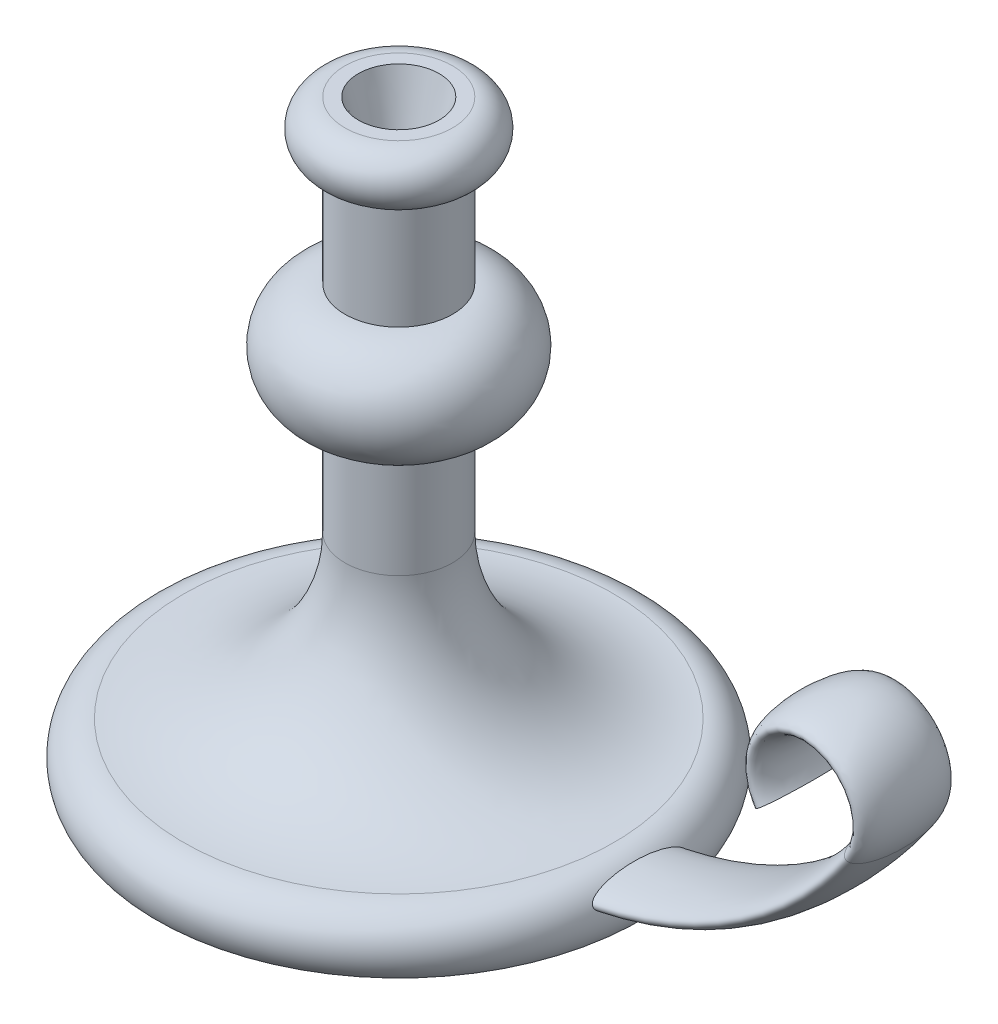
ISO-10303-21;
HEADER;
FILE_DESCRIPTION(('STEP AP214'),'2;1');
FILE_NAME('part.step','',(''),(''),'','','');
FILE_SCHEMA(('AUTOMOTIVE_DESIGN { 1 0 10303 214 1 1 1 1 }'));
ENDSEC;
DATA;
#1=APPLICATION_CONTEXT('core data for automotive mechanical design processes');
#2=APPLICATION_PROTOCOL_DEFINITION('international standard','automotive_design',2000,#1);
#3=PRODUCT_CONTEXT('',#1,'mechanical');
#4=PRODUCT('Part','Part','',(#3));
#5=PRODUCT_RELATED_PRODUCT_CATEGORY('part','',(#4));
#6=PRODUCT_DEFINITION_FORMATION('','',#4);
#7=PRODUCT_DEFINITION_CONTEXT('part definition',#1,'design');
#8=PRODUCT_DEFINITION('design','',#6,#7);
#9=PRODUCT_DEFINITION_SHAPE('','',#8);
#10=(LENGTH_UNIT() NAMED_UNIT(*) SI_UNIT(.MILLI.,.METRE.));
#11=(NAMED_UNIT(*) PLANE_ANGLE_UNIT() SI_UNIT($,.RADIAN.));
#12=(NAMED_UNIT(*) SI_UNIT($,.STERADIAN.) SOLID_ANGLE_UNIT());
#13=UNCERTAINTY_MEASURE_WITH_UNIT(LENGTH_MEASURE(1.E-05),#10,'distance_accuracy_value','');
#14=(GEOMETRIC_REPRESENTATION_CONTEXT(3) GLOBAL_UNCERTAINTY_ASSIGNED_CONTEXT((#13)) GLOBAL_UNIT_ASSIGNED_CONTEXT((#10,
#11,#12)) REPRESENTATION_CONTEXT('',''));
#15=CARTESIAN_POINT('',(0.,0.,0.));
#16=DIRECTION('',(0.,0.,1.));
#17=DIRECTION('',(1.,0.,0.));
#18=AXIS2_PLACEMENT_3D('',#15,#16,#17);
#19=CARTESIAN_POINT('',(0.,220.,0.));
#20=DIRECTION('',(0.,-1.,0.));
#21=DIRECTION('',(1.,0.,0.));
#22=AXIS2_PLACEMENT_3D('',#19,#20,#21);
#23=PLANE('',#22);
#24=CARTESIAN_POINT('',(0.,220.,0.));
#25=DIRECTION('',(0.,1.,0.));
#26=DIRECTION('',(0.,0.,1.));
#27=AXIS2_PLACEMENT_3D('',#24,#25,#26);
#28=CIRCLE('',#27,15.);
#29=CARTESIAN_POINT('',(0.,220.,15.));
#30=VERTEX_POINT('',#29);
#31=EDGE_CURVE('E128',#30,#30,#28,.T.);
#32=ORIENTED_EDGE('',*,*,#31,.F.);
#33=EDGE_LOOP('',(#32));
#34=FACE_BOUND('',#33,.T.);
#35=CARTESIAN_POINT('',(0.,220.,0.));
#36=DIRECTION('',(0.,1.,0.));
#37=DIRECTION('',(-1.,0.,0.));
#38=AXIS2_PLACEMENT_3D('',#35,#36,#37);
#39=CIRCLE('',#38,20.);
#40=CARTESIAN_POINT('',(-20.,220.,0.));
#41=VERTEX_POINT('',#40);
#42=EDGE_CURVE('E10',#41,#41,#39,.T.);
#43=ORIENTED_EDGE('',*,*,#42,.T.);
#44=EDGE_LOOP('',(#43));
#45=FACE_BOUND('',#44,.T.);
#46=ADVANCED_FACE('F30',(#34,#45),#23,.F.);
#47=CARTESIAN_POINT('',(0.,210.,0.));
#48=DIRECTION('',(0.,1.,0.));
#49=DIRECTION('',(-1.,0.,0.));
#50=AXIS2_PLACEMENT_3D('',#47,#48,#49);
#51=TOROIDAL_SURFACE('',#50,20.,10.);
#52=ORIENTED_EDGE('',*,*,#42,.F.);
#53=EDGE_LOOP('',(#52));
#54=FACE_BOUND('',#53,.T.);
#55=CARTESIAN_POINT('',(0.,200.,0.));
#56=DIRECTION('',(0.,1.,0.));
#57=DIRECTION('',(-1.,0.,0.));
#58=AXIS2_PLACEMENT_3D('',#55,#56,#57);
#59=CIRCLE('',#58,20.);
#60=CARTESIAN_POINT('',(-20.,200.,0.));
#61=VERTEX_POINT('',#60);
#62=EDGE_CURVE('E41',#61,#61,#59,.T.);
#63=ORIENTED_EDGE('',*,*,#62,.T.);
#64=EDGE_LOOP('',(#63));
#65=FACE_BOUND('',#64,.T.);
#66=ADVANCED_FACE('F103',(#54,#65),#51,.T.);
#67=CARTESIAN_POINT('',(0.,220.,0.));
#68=DIRECTION('',(0.,1.,0.));
#69=DIRECTION('',(-1.,0.,0.));
#70=AXIS2_PLACEMENT_3D('',#67,#68,#69);
#71=CYLINDRICAL_SURFACE('',#70,20.);
#72=ORIENTED_EDGE('',*,*,#62,.F.);
#73=EDGE_LOOP('',(#72));
#74=FACE_BOUND('',#73,.T.);
#75=CARTESIAN_POINT('',(0.,160.,0.));
#76=DIRECTION('',(0.,1.,0.));
#77=DIRECTION('',(-1.,0.,0.));
#78=AXIS2_PLACEMENT_3D('',#75,#76,#77);
#79=CIRCLE('',#78,20.);
#80=CARTESIAN_POINT('',(-20.,160.,0.));
#81=VERTEX_POINT('',#80);
#82=EDGE_CURVE('E45',#81,#81,#79,.T.);
#83=ORIENTED_EDGE('',*,*,#82,.T.);
#84=EDGE_LOOP('',(#83));
#85=FACE_BOUND('',#84,.T.);
#86=ADVANCED_FACE('F100',(#74,#85),#71,.T.);
#87=CARTESIAN_POINT('',(0.,140.,0.));
#88=DIRECTION('',(0.,1.,0.));
#89=DIRECTION('',(-1.,0.,0.));
#90=AXIS2_PLACEMENT_3D('',#87,#88,#89);
#91=TOROIDAL_SURFACE('',#90,20.,20.);
#92=ORIENTED_EDGE('',*,*,#82,.F.);
#93=EDGE_LOOP('',(#92));
#94=FACE_BOUND('',#93,.T.);
#95=CARTESIAN_POINT('',(0.,120.,0.));
#96=DIRECTION('',(0.,1.,0.));
#97=DIRECTION('',(-1.,0.,0.));
#98=AXIS2_PLACEMENT_3D('',#95,#96,#97);
#99=CIRCLE('',#98,20.);
#100=CARTESIAN_POINT('',(-20.,120.,0.));
#101=VERTEX_POINT('',#100);
#102=EDGE_CURVE('E50',#101,#101,#99,.T.);
#103=ORIENTED_EDGE('',*,*,#102,.T.);
#104=EDGE_LOOP('',(#103));
#105=FACE_BOUND('',#104,.T.);
#106=ADVANCED_FACE('F96',(#94,#105),#91,.T.);
#107=CARTESIAN_POINT('',(0.,220.,0.));
#108=DIRECTION('',(0.,1.,0.));
#109=DIRECTION('',(-1.,0.,0.));
#110=AXIS2_PLACEMENT_3D('',#107,#108,#109);
#111=CYLINDRICAL_SURFACE('',#110,20.);
#112=ORIENTED_EDGE('',*,*,#102,.F.);
#113=EDGE_LOOP('',(#112));
#114=FACE_BOUND('',#113,.T.);
#115=CARTESIAN_POINT('',(0.,80.,0.));
#116=DIRECTION('',(0.,1.,0.));
#117=DIRECTION('',(-1.,0.,0.));
#118=AXIS2_PLACEMENT_3D('',#115,#116,#117);
#119=CIRCLE('',#118,20.);
#120=CARTESIAN_POINT('',(-20.,80.,0.));
#121=VERTEX_POINT('',#120);
#122=EDGE_CURVE('E53',#121,#121,#119,.T.);
#123=ORIENTED_EDGE('',*,*,#122,.T.);
#124=EDGE_LOOP('',(#123));
#125=FACE_BOUND('',#124,.T.);
#126=ADVANCED_FACE('F92',(#114,#125),#111,.T.);
#127=CARTESIAN_POINT('',(0.,80.,0.));
#128=DIRECTION('',(0.,1.,0.));
#129=DIRECTION('',(-1.,0.,0.));
#130=AXIS2_PLACEMENT_3D('',#127,#128,#129);
#131=TOROIDAL_SURFACE('',#130,80.,60.);
#132=ORIENTED_EDGE('',*,*,#122,.F.);
#133=EDGE_LOOP('',(#132));
#134=FACE_BOUND('',#133,.T.);
#135=CARTESIAN_POINT('',(0.,20.,0.));
#136=DIRECTION('',(0.,1.,0.));
#137=DIRECTION('',(-1.,0.,0.));
#138=AXIS2_PLACEMENT_3D('',#135,#136,#137);
#139=CIRCLE('',#138,79.9999999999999);
#140=CARTESIAN_POINT('',(-79.9999999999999,20.,0.));
#141=VERTEX_POINT('',#140);
#142=EDGE_CURVE('E56',#141,#141,#139,.T.);
#143=ORIENTED_EDGE('',*,*,#142,.T.);
#144=EDGE_LOOP('',(#143));
#145=FACE_BOUND('',#144,.T.);
#146=ADVANCED_FACE('F88',(#134,#145),#131,.F.);
#147=CARTESIAN_POINT('',(0.,7.49999999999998,0.));
#148=DIRECTION('',(0.,1.,0.));
#149=DIRECTION('',(-1.,0.,0.));
#150=AXIS2_PLACEMENT_3D('',#147,#148,#149);
#151=TOROIDAL_SURFACE('',#150,80.,12.5);
#152=CARTESIAN_POINT('',(89.5597422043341,12.9414346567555,-17.5));
#153=CARTESIAN_POINT('',(89.5807326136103,12.8988294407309,-17.5000043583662));
#154=CARTESIAN_POINT('',(89.6018187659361,12.8562913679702,-17.4977817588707));
#155=CARTESIAN_POINT('',(89.6440239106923,12.771677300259,-17.488999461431));
#156=CARTESIAN_POINT('',(89.6651429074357,12.7296013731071,-17.4824391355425));
#157=CARTESIAN_POINT('',(89.7283355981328,12.6044945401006,-17.4565182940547));
#158=CARTESIAN_POINT('',(89.7702278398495,12.5226193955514,-17.4309181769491));
#159=CARTESIAN_POINT('',(89.8644343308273,12.3407607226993,-17.3563476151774));
#160=CARTESIAN_POINT('',(89.9162250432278,12.2424596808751,-17.3027388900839));
#161=CARTESIAN_POINT('',(90.0164003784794,12.0551227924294,-17.1788082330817));
#162=CARTESIAN_POINT('',(90.0647770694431,11.9661083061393,-17.1084489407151));
#163=CARTESIAN_POINT('',(90.152443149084,11.8070027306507,-16.965255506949));
#164=CARTESIAN_POINT('',(90.1921264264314,11.7359226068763,-16.8937312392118));
#165=CARTESIAN_POINT('',(90.2690510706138,11.5996920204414,-16.7439728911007));
#166=CARTESIAN_POINT('',(90.3062903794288,11.5345465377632,-16.6657332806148));
#167=CARTESIAN_POINT('',(90.3786318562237,11.409329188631,-16.5040792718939));
#168=CARTESIAN_POINT('',(90.4137288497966,11.3492694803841,-16.4206532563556));
#169=CARTESIAN_POINT('',(90.4819296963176,11.2337150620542,-16.2499860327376));
#170=CARTESIAN_POINT('',(90.5150341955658,11.1782188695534,-16.1627460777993));
#171=CARTESIAN_POINT('',(90.5789571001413,11.0720519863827,-15.9866986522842));
#172=CARTESIAN_POINT('',(90.609803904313,11.021317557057,-15.8979396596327));
#173=CARTESIAN_POINT('',(90.6699705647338,10.9232104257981,-15.7180696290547));
#174=CARTESIAN_POINT('',(90.699290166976,10.8758382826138,-15.6269582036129));
#175=CARTESIAN_POINT('',(90.7852716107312,10.7380357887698,-15.350489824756));
#176=CARTESIAN_POINT('',(90.8398641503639,10.6520711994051,-15.1622572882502));
#177=CARTESIAN_POINT('',(90.9444828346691,10.4896350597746,-14.7803939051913));
#178=CARTESIAN_POINT('',(90.9945051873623,10.4131713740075,-14.5867587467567));
#179=CARTESIAN_POINT('',(91.0908253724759,10.2677992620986,-14.1946841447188));
#180=CARTESIAN_POINT('',(91.1371044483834,10.1989283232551,-13.9962262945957));
#181=CARTESIAN_POINT('',(91.2261147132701,10.0679903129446,-13.5965649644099));
#182=CARTESIAN_POINT('',(91.2688497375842,10.0059158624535,-13.3953647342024));
#183=CARTESIAN_POINT('',(91.3511812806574,9.88757739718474,-12.9907120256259));
#184=CARTESIAN_POINT('',(91.3907787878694,9.8313115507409,-12.7872602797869));
#185=CARTESIAN_POINT('',(91.4896098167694,9.69221123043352,-12.2582148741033));
#186=CARTESIAN_POINT('',(91.5466849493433,9.61322822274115,-11.9312038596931));
#187=CARTESIAN_POINT('',(91.6545217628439,9.46589155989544,-11.2737369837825));
#188=CARTESIAN_POINT('',(91.705282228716,9.39753994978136,-10.9432804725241));
#189=CARTESIAN_POINT('',(91.8011371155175,9.26988836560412,-10.2792469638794));
#190=CARTESIAN_POINT('',(91.8462221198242,9.21060340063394,-9.94566574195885));
#191=CARTESIAN_POINT('',(91.9310567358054,9.10011232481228,-9.27649037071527));
#192=CARTESIAN_POINT('',(91.9708061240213,9.04890655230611,-8.94089613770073));
#193=CARTESIAN_POINT('',(92.0453160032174,8.95370640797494,-8.26785551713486));
#194=CARTESIAN_POINT('',(92.0800723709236,8.90971799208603,-7.93040783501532));
#195=CARTESIAN_POINT('',(92.1447961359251,8.82837367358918,-7.25426152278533));
#196=CARTESIAN_POINT('',(92.1747634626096,8.79101786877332,-6.91556287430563));
#197=CARTESIAN_POINT('',(92.2579347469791,8.68793030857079,-5.89595186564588));
#198=CARTESIAN_POINT('',(92.3041906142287,8.63145287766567,-5.21351228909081));
#199=CARTESIAN_POINT('',(92.3791624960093,8.54049225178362,-3.84703641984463));
#200=CARTESIAN_POINT('',(92.4078979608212,8.50598466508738,-3.16300274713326));
#201=CARTESIAN_POINT('',(92.4484303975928,8.45743627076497,-1.79406719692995));
#202=CARTESIAN_POINT('',(92.460236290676,8.44338468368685,-1.10916596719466));
#203=CARTESIAN_POINT('',(92.466537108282,8.4358806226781,0.141352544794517));
#204=CARTESIAN_POINT('',(92.4636919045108,8.43926314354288,0.706942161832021));
#205=CARTESIAN_POINT('',(92.4465729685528,8.45968457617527,1.83788432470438));
#206=CARTESIAN_POINT('',(92.432295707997,8.47672770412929,2.40323674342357));
#207=CARTESIAN_POINT('',(92.3921229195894,8.52495842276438,3.53335472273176));
#208=CARTESIAN_POINT('',(92.3662187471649,8.55615653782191,4.09811953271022));
#209=CARTESIAN_POINT('',(92.3024132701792,8.63366036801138,5.2266887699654));
#210=CARTESIAN_POINT('',(92.2644962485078,8.6799858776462,5.79049096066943));
#211=CARTESIAN_POINT('',(92.1763637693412,8.78891090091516,6.91254967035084));
#212=CARTESIAN_POINT('',(92.1262149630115,8.8514223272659,7.47081972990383));
#213=CARTESIAN_POINT('',(92.0410617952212,8.95917340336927,8.30529414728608));
#214=CARTESIAN_POINT('',(92.0110273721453,8.99741467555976,8.5829247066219));
#215=CARTESIAN_POINT('',(91.947493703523,9.0789632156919,9.13703937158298));
#216=CARTESIAN_POINT('',(91.9139945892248,9.12227029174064,9.4135235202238));
#217=CARTESIAN_POINT('',(91.8434021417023,9.21436156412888,9.96465897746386));
#218=CARTESIAN_POINT('',(91.8063146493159,9.26313687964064,10.2393125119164));
#219=CARTESIAN_POINT('',(91.7282651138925,9.36683362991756,10.78689321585));
#220=CARTESIAN_POINT('',(91.6873033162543,9.42175467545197,11.0598204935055));
#221=CARTESIAN_POINT('',(91.6012576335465,9.53845302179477,11.6031386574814));
#222=CARTESIAN_POINT('',(91.5561797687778,9.6002203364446,11.8735326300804));
#223=CARTESIAN_POINT('',(91.4614540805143,9.73169854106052,12.4115566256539));
#224=CARTESIAN_POINT('',(91.4118069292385,9.80140826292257,12.6791870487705));
#225=CARTESIAN_POINT('',(91.3248007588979,9.92537019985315,13.1221682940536));
#226=CARTESIAN_POINT('',(91.2888657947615,9.97702380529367,13.2985267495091));
#227=CARTESIAN_POINT('',(91.2144917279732,10.0850501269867,13.6493153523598));
#228=CARTESIAN_POINT('',(91.1760520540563,10.1414239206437,13.823745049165));
#229=CARTESIAN_POINT('',(91.0963758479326,10.25960948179,14.1702651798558));
#230=CARTESIAN_POINT('',(91.0551373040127,10.3214251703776,14.3423538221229));
#231=CARTESIAN_POINT('',(90.9696215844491,10.4512210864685,14.6830229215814));
#232=CARTESIAN_POINT('',(90.9253507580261,10.5191885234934,14.8516098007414));
#233=CARTESIAN_POINT('',(90.8332595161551,10.6625274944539,15.1845299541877));
#234=CARTESIAN_POINT('',(90.7854409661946,10.7378951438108,15.3488654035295));
#235=CARTESIAN_POINT('',(90.6856684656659,10.8975577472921,15.6716834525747));
#236=CARTESIAN_POINT('',(90.6337193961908,10.9818422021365,15.8301726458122));
#237=CARTESIAN_POINT('',(90.5455798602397,11.1273013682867,16.0800508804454));
#238=CARTESIAN_POINT('',(90.5109327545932,11.1850350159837,16.1739841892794));
#239=CARTESIAN_POINT('',(90.4394482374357,11.3054868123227,16.3578231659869));
#240=CARTESIAN_POINT('',(90.4026100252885,11.3682067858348,16.4477273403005));
#241=CARTESIAN_POINT('',(90.3266185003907,11.4991514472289,16.621823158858));
#242=CARTESIAN_POINT('',(90.2874749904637,11.5673532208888,16.706036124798));
#243=CARTESIAN_POINT('',(90.2064635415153,11.7103404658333,16.8671906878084));
#244=CARTESIAN_POINT('',(90.1645984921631,11.7851189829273,16.9441397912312));
#245=CARTESIAN_POINT('',(90.0803556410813,11.9377027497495,17.0839432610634));
#246=CARTESIAN_POINT('',(90.0381466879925,12.0150846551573,17.1473545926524));
#247=CARTESIAN_POINT('',(89.9509421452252,12.1772165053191,17.2620974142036));
#248=CARTESIAN_POINT('',(89.9059460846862,12.2619676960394,17.3134268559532));
#249=CARTESIAN_POINT('',(89.8364072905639,12.3948813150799,17.3783975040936));
#250=CARTESIAN_POINT('',(89.8126986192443,12.4405200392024,17.3981535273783));
#251=CARTESIAN_POINT('',(89.7648280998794,12.5333550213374,17.4328348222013));
#252=CARTESIAN_POINT('',(89.7406665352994,12.5805503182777,17.4477630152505));
#253=CARTESIAN_POINT('',(89.6921132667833,12.6760967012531,17.4722367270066));
#254=CARTESIAN_POINT('',(89.6677220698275,12.7244454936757,17.4817921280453));
#255=CARTESIAN_POINT('',(89.6189078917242,12.8219161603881,17.4951580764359));
#256=CARTESIAN_POINT('',(89.5944849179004,12.8710378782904,17.4989697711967));
#257=CARTESIAN_POINT('',(89.5492639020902,12.9626381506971,17.5005478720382));
#258=CARTESIAN_POINT('',(89.5284345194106,13.0050895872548,17.4990819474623));
#259=CARTESIAN_POINT('',(89.4871141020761,13.0897992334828,17.4917926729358));
#260=CARTESIAN_POINT('',(89.466623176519,13.1320573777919,17.4859679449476));
#261=CARTESIAN_POINT('',(89.4261276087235,13.2160391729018,17.4701219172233));
#262=CARTESIAN_POINT('',(89.4061232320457,13.2577625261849,17.460098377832));
#263=CARTESIAN_POINT('',(89.3667204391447,13.3403788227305,17.4361275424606));
#264=CARTESIAN_POINT('',(89.3473223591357,13.3812713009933,17.4221781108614));
#265=CARTESIAN_POINT('',(89.3048153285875,13.4713192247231,17.3870615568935));
#266=CARTESIAN_POINT('',(89.2818851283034,13.5201996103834,17.3649713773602));
#267=CARTESIAN_POINT('',(89.237145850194,13.6160907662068,17.3160654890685));
#268=CARTESIAN_POINT('',(89.2153376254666,13.6631001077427,17.2892462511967));
#269=CARTESIAN_POINT('',(89.1515800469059,13.8012024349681,17.2026931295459));
#270=CARTESIAN_POINT('',(89.1113284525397,13.8893044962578,17.1368909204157));
#271=CARTESIAN_POINT('',(89.0404749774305,14.0455293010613,17.0041144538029));
#272=CARTESIAN_POINT('',(89.009314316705,14.1147130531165,16.9386317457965));
#273=CARTESIAN_POINT('',(88.9496516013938,14.2478382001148,16.8013459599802));
#274=CARTESIAN_POINT('',(88.9211516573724,14.3117754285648,16.7295379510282));
#275=CARTESIAN_POINT('',(88.8664029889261,14.4350632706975,16.5810184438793));
#276=CARTESIAN_POINT('',(88.8401597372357,14.4944027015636,16.5042957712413));
#277=CARTESIAN_POINT('',(88.7896666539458,14.6088849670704,16.3472138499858));
#278=CARTESIAN_POINT('',(88.7654162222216,14.6640290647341,16.2668557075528));
#279=CARTESIAN_POINT('',(88.7193355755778,14.769001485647,16.1057794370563));
#280=CARTESIAN_POINT('',(88.6974539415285,14.818940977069,16.0251479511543));
#281=CARTESIAN_POINT('',(88.6550760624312,14.9157526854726,15.8617018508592));
#282=CARTESIAN_POINT('',(88.6345800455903,14.96262439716,15.7788868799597));
#283=CARTESIAN_POINT('',(88.5748401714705,15.0992771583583,15.5275359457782));
#284=CARTESIAN_POINT('',(88.5374096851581,15.1849468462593,15.3563282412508));
#285=CARTESIAN_POINT('',(88.4662925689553,15.3474324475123,15.0089066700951));
#286=CARTESIAN_POINT('',(88.4326090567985,15.4242409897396,14.8326887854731));
#287=CARTESIAN_POINT('',(88.3681108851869,15.5708010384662,14.4757479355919));
#288=CARTESIAN_POINT('',(88.3373120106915,15.6405138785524,14.2950063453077));
#289=CARTESIAN_POINT('',(88.2782763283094,15.7734782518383,13.9309996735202));
#290=CARTESIAN_POINT('',(88.2500367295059,15.8367368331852,13.7477375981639));
#291=CARTESIAN_POINT('',(88.1957007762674,15.9577129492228,13.3791589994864));
#292=CARTESIAN_POINT('',(88.1696037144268,16.0154323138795,13.1938431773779));
#293=CARTESIAN_POINT('',(88.1125579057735,16.140721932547,12.7720406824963));
#294=CARTESIAN_POINT('',(88.0821635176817,16.2068322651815,12.5350462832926));
#295=CARTESIAN_POINT('',(88.0238960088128,16.3323305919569,12.0589645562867));
#296=CARTESIAN_POINT('',(87.9960231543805,16.3917178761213,11.819877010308));
#297=CARTESIAN_POINT('',(87.9424707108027,16.5046262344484,11.3397669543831));
#298=CARTESIAN_POINT('',(87.9167938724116,16.5581399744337,11.0987424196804));
#299=CARTESIAN_POINT('',(87.8674611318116,16.659838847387,10.6153617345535));
#300=CARTESIAN_POINT('',(87.8438053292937,16.7080237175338,10.3730055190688));
#301=CARTESIAN_POINT('',(87.7755757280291,16.845473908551,9.64368858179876));
#302=CARTESIAN_POINT('',(87.7338067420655,16.9274944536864,9.15508931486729));
#303=CARTESIAN_POINT('',(87.6570389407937,17.0751976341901,8.17482642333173));
#304=CARTESIAN_POINT('',(87.6220418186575,17.1408761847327,7.68316206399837));
#305=CARTESIAN_POINT('',(87.5585154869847,17.2579388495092,6.69696520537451));
#306=CARTESIAN_POINT('',(87.5299962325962,17.309300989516,6.2024294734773));
#307=CARTESIAN_POINT('',(87.4794677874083,17.3989391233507,5.2123832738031));
#308=CARTESIAN_POINT('',(87.4574517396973,17.437228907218,4.71687439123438));
#309=CARTESIAN_POINT('',(87.4199534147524,17.50172701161,3.7250958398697));
#310=CARTESIAN_POINT('',(87.4044676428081,17.527941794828,3.22882672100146));
#311=CARTESIAN_POINT('',(87.3800967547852,17.568925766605,2.235727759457));
#312=CARTESIAN_POINT('',(87.3712107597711,17.5836964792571,1.73889800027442));
#313=CARTESIAN_POINT('',(87.3584341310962,17.6049095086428,0.595691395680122));
#314=CARTESIAN_POINT('',(87.3568451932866,17.6075183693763,-0.0507866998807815));
#315=CARTESIAN_POINT('',(87.3649597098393,17.5940801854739,-1.34369690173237));
#316=CARTESIAN_POINT('',(87.3746670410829,17.5780267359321,-1.99012891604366));
#317=CARTESIAN_POINT('',(87.4052636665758,17.5266290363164,-3.28224452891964));
#318=CARTESIAN_POINT('',(87.4261577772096,17.4912764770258,-3.92792768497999));
#319=CARTESIAN_POINT('',(87.4788363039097,17.4000698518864,-5.21481955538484));
#320=CARTESIAN_POINT('',(87.5105764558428,17.3442990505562,-5.85603581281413));
#321=CARTESIAN_POINT('',(87.5663284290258,17.243449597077,-6.81545056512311));
#322=CARTESIAN_POINT('',(87.5862659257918,17.2069740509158,-7.13480812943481));
#323=CARTESIAN_POINT('',(87.6288912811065,17.1278468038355,-7.77256954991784));
#324=CARTESIAN_POINT('',(87.6515790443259,17.0851953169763,-8.09097343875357));
#325=CARTESIAN_POINT('',(87.6997653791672,16.993203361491,-8.72641485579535));
#326=CARTESIAN_POINT('',(87.7252623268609,16.9438667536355,-9.04345306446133));
#327=CARTESIAN_POINT('',(87.7792146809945,16.8377972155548,-9.67602629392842));
#328=CARTESIAN_POINT('',(87.8076698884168,16.7810647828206,-9.99156141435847));
#329=CARTESIAN_POINT('',(87.8585831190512,16.6779236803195,-10.5244958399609));
#330=CARTESIAN_POINT('',(87.8802132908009,16.6336650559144,-10.7423912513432));
#331=CARTESIAN_POINT('',(87.9251320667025,16.5407657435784,-11.1770778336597));
#332=CARTESIAN_POINT('',(87.948420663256,16.4921250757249,-11.3938690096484));
#333=CARTESIAN_POINT('',(87.9968275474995,16.3899718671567,-11.8262155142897));
#334=CARTESIAN_POINT('',(88.0219467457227,16.3364568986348,-12.0417701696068));
#335=CARTESIAN_POINT('',(88.0742222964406,16.2239959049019,-12.4712113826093));
#336=CARTESIAN_POINT('',(88.1013785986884,16.1650500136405,-12.685097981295));
#337=CARTESIAN_POINT('',(88.1569500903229,16.0433492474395,-13.1026692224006));
#338=CARTESIAN_POINT('',(88.1852780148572,15.9808247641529,-13.3064322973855));
#339=CARTESIAN_POINT('',(88.2444607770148,15.8492229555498,-13.7114595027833));
#340=CARTESIAN_POINT('',(88.2753154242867,15.7801461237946,-13.9127238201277));
#341=CARTESIAN_POINT('',(88.3400652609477,15.6343136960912,-14.3120017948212));
#342=CARTESIAN_POINT('',(88.3739608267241,15.557557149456,-14.5100150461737));
#343=CARTESIAN_POINT('',(88.4454959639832,15.3948944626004,-14.9015440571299));
#344=CARTESIAN_POINT('',(88.4831342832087,15.3089913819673,-15.0950612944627));
#345=CARTESIAN_POINT('',(88.5467273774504,15.163612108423,-15.3973251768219));
#346=CARTESIAN_POINT('',(88.5711128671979,15.1078158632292,-15.5081719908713));
#347=CARTESIAN_POINT('',(88.6218429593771,14.9917550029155,-15.727031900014));
#348=CARTESIAN_POINT('',(88.648187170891,14.9314912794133,-15.8350455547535));
#349=CARTESIAN_POINT('',(88.7031881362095,14.8058402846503,-16.0473489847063));
#350=CARTESIAN_POINT('',(88.7318430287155,14.7404571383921,-16.1516416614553));
#351=CARTESIAN_POINT('',(88.7919488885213,14.603689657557,-16.3553375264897));
#352=CARTESIAN_POINT('',(88.8233985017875,14.5323082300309,-16.4547430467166));
#353=CARTESIAN_POINT('',(88.8951741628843,14.3701203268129,-16.6628055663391));
#354=CARTESIAN_POINT('',(88.9361089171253,14.2780512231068,-16.7702876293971));
#355=CARTESIAN_POINT('',(89.0237781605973,14.0824447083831,-16.9718086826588));
#356=CARTESIAN_POINT('',(89.070505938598,13.9789205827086,-17.0658629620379));
#357=CARTESIAN_POINT('',(89.1571110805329,13.7892409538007,-17.2101867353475));
#358=CARTESIAN_POINT('',(89.1953409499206,13.7061329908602,-17.2653852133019));
#359=CARTESIAN_POINT('',(89.2756134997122,13.5334057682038,-17.3607930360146));
#360=CARTESIAN_POINT('',(89.3176473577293,13.443801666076,-17.4010360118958));
#361=CARTESIAN_POINT('',(89.3930039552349,13.2850896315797,-17.4539041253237));
#362=CARTESIAN_POINT('',(89.4255419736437,13.2171244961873,-17.4710813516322));
#363=CARTESIAN_POINT('',(89.4918836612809,13.079858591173,-17.4941239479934));
#364=CARTESIAN_POINT('',(89.5256869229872,13.0105582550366,-17.4999929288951));
#365=CARTESIAN_POINT('',(89.5597422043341,12.9414346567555,-17.5));
#366=B_SPLINE_CURVE_WITH_KNOTS('',3,(#152,#153,#154,#155,#156,#157,#158,#159,#160,#161,#162,
#163,#164,#165,#166,#167,#168,#169,#170,#171,#172,#173,#174,#175,#176,#177,#178,#179,#180,#181,
#182,#183,#184,#185,#186,#187,#188,#189,#190,#191,#192,#193,#194,#195,#196,#197,#198,#199,#200,
#201,#202,#203,#204,#205,#206,#207,#208,#209,#210,#211,#212,#213,#214,#215,#216,#217,#218,#219,
#220,#221,#222,#223,#224,#225,#226,#227,#228,#229,#230,#231,#232,#233,#234,#235,#236,#237,#238,
#239,#240,#241,#242,#243,#244,#245,#246,#247,#248,#249,#250,#251,#252,#253,#254,#255,#256,#257,
#258,#259,#260,#261,#262,#263,#264,#265,#266,#267,#268,#269,#270,#271,#272,#273,#274,#275,#276,
#277,#278,#279,#280,#281,#282,#283,#284,#285,#286,#287,#288,#289,#290,#291,#292,#293,#294,#295,
#296,#297,#298,#299,#300,#301,#302,#303,#304,#305,#306,#307,#308,#309,#310,#311,#312,#313,#314,
#315,#316,#317,#318,#319,#320,#321,#322,#323,#324,#325,#326,#327,#328,#329,#330,#331,#332,#333,
#334,#335,#336,#337,#338,#339,#340,#341,#342,#343,#344,#345,#346,#347,#348,#349,#350,#351,#352,
#353,#354,#355,#356,#357,#358,#359,#360,#361,#362,#363,#364,#365),.UNSPECIFIED.,.T.,.F.,(4,2,2,
2,2,2,2,2,2,2,2,2,2,2,2,2,2,2,2,2,2,2,2,2,2,2,2,2,2,2,2,2,2,2,2,2,2,2,2,2,2,2,2,2,2,2,2,2,2,2,2,
2,2,2,2,2,2,2,2,2,2,2,2,2,2,2,2,2,2,2,2,2,2,2,2,2,2,2,2,2,2,2,2,2,2,2,2,2,2,2,2,2,2,2,2,2,2,2,2,
2,2,2,2,2,2,2,4),(0.,0.14240046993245,0.284821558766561,0.569778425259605,0.93783834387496,
1.30672700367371,1.63135439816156,1.95625173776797,2.28190506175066,2.60745217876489,
2.92771144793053,3.24802381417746,3.88958693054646,4.53167762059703,5.17680851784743,
5.82123189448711,6.46545143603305,7.48880110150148,8.51234737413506,9.53757011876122,
10.5628357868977,11.5889433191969,12.6150659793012,14.6733608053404,16.7293664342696,
18.7842882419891,20.4808442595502,22.1779241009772,23.8762678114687,25.5768428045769,
27.2683506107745,28.1138649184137,28.9593472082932,29.8034757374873,30.6475508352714,
31.490410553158,32.3331464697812,32.8948186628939,33.4566194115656,34.0188283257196,
34.5798940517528,35.1406668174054,35.7007864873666,36.0473499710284,36.394040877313,
36.7393512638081,37.0843008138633,37.4093543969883,37.7344630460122,37.8995476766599,
38.0645322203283,38.2292123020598,38.3938594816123,38.5355870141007,38.6773593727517,
38.8192074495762,38.9611328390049,39.1358662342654,39.3107305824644,39.6606874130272,
39.9609806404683,40.2615100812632,40.5627489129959,40.8638966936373,41.1558075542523,
41.4477663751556,42.0325374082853,42.6177914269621,43.2060807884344,43.7937206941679,
44.3811657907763,45.1247660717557,45.8684448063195,46.6130418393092,47.35767557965,
48.8488292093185,50.3403551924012,51.83415806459,53.3263802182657,54.8178027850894,
56.3090266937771,58.2481010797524,60.1878411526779,62.1284170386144,64.0611659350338,
65.0272625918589,65.9933257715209,66.9588333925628,67.9242761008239,68.5944153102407,
69.2645514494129,69.9350232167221,70.6054784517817,71.2504133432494,71.8952996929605,
72.5402659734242,73.1850171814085,73.564330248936,73.9435678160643,74.3225028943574,
74.7012553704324,75.1424233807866,75.5830849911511,75.9026214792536,76.2214349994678,
76.452542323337,76.6835758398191),.UNSPECIFIED.);
#367=CARTESIAN_POINT('',(89.5597422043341,12.9414346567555,-17.5));
#368=VERTEX_POINT('',#367);
#369=EDGE_CURVE('E33',#368,#368,#366,.T.);
#370=ORIENTED_EDGE('',*,*,#369,.T.);
#371=EDGE_LOOP('',(#370));
#372=FACE_BOUND('',#371,.T.);
#373=ORIENTED_EDGE('',*,*,#142,.F.);
#374=EDGE_LOOP('',(#373));
#375=FACE_BOUND('',#374,.T.);
#376=CARTESIAN_POINT('',(0.,0.,0.));
#377=DIRECTION('',(0.,1.,0.));
#378=DIRECTION('',(-1.,0.,0.));
#379=AXIS2_PLACEMENT_3D('',#376,#377,#378);
#380=CIRCLE('',#379,90.);
#381=CARTESIAN_POINT('',(-90.,0.,0.));
#382=VERTEX_POINT('',#381);
#383=EDGE_CURVE('E59',#382,#382,#380,.T.);
#384=ORIENTED_EDGE('',*,*,#383,.T.);
#385=EDGE_LOOP('',(#384));
#386=FACE_BOUND('',#385,.T.);
#387=ADVANCED_FACE('F83',(#372,#375,#386),#151,.T.);
#388=CARTESIAN_POINT('',(0.,0.,0.));
#389=DIRECTION('',(0.,1.,0.));
#390=DIRECTION('',(-1.,0.,0.));
#391=AXIS2_PLACEMENT_3D('',#388,#389,#390);
#392=PLANE('',#391);
#393=ORIENTED_EDGE('',*,*,#383,.F.);
#394=EDGE_LOOP('',(#393));
#395=FACE_BOUND('',#394,.T.);
#396=ADVANCED_FACE('F81',(#395),#392,.F.);
#397=CARTESIAN_POINT('',(60.,10.,0.));
#398=DIRECTION('',(1.,0.,0.));
#399=DIRECTION('',(0.,0.,-1.));
#400=AXIS2_PLACEMENT_3D('',#397,#398,#399);
#401=ELLIPSE('',#400,17.5,5.);
#402=CARTESIAN_POINT('',(60.,160.,0.));
#403=DIRECTION('',(0.,0.,1.));
#404=AXIS1_PLACEMENT('',#402,#403);
#405=SURFACE_OF_REVOLUTION('',#401,#404);
#406=CARTESIAN_POINT('',(183.592070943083,75.,0.));
#407=DIRECTION('',(0.566666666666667,0.823947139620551,0.));
#408=DIRECTION('',(0.,0.,-1.));
#409=AXIS2_PLACEMENT_3D('',#406,#407,#408);
#410=ELLIPSE('',#409,17.5,5.);
#411=CARTESIAN_POINT('',(183.592070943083,75.,-17.5));
#412=VERTEX_POINT('',#411);
#413=EDGE_CURVE('E65',#412,#412,#410,.T.);
#414=ORIENTED_EDGE('',*,*,#413,.F.);
#415=EDGE_LOOP('',(#414));
#416=FACE_BOUND('',#415,.T.);
#417=ORIENTED_EDGE('',*,*,#369,.F.);
#418=EDGE_LOOP('',(#417));
#419=FACE_BOUND('',#418,.T.);
#420=ADVANCED_FACE('F77',(#416,#419),#405,.F.);
#421=CARTESIAN_POINT('',(167.113128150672,86.3333333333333,0.));
#422=DIRECTION('',(0.,0.,1.));
#423=AXIS1_PLACEMENT('',#421,#422);
#424=SURFACE_OF_REVOLUTION('',#410,#423);
#425=ORIENTED_EDGE('',*,*,#413,.T.);
#426=EDGE_LOOP('',(#425));
#427=FACE_BOUND('',#426,.T.);
#428=CARTESIAN_POINT('',(150.634185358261,74.9999999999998,0.));
#429=DIRECTION('',(0.566666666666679,-0.823947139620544,0.));
#430=DIRECTION('',(0.,0.,-1.));
#431=AXIS2_PLACEMENT_3D('',#428,#429,#430);
#432=ELLIPSE('',#431,17.5,5.);
#433=CARTESIAN_POINT('',(150.634185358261,74.9999999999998,-17.5));
#434=VERTEX_POINT('',#433);
#435=EDGE_CURVE('E62',#434,#434,#432,.T.);
#436=ORIENTED_EDGE('',*,*,#435,.F.);
#437=EDGE_LOOP('',(#436));
#438=FACE_BOUND('',#437,.T.);
#439=ADVANCED_FACE('F73',(#427,#438),#424,.F.);
#440=CARTESIAN_POINT('',(150.634185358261,74.9999999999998,0.));
#441=DIRECTION('',(0.566666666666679,-0.823947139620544,0.));
#442=DIRECTION('',(0.,0.,-1.));
#443=AXIS2_PLACEMENT_3D('',#440,#441,#442);
#444=PLANE('',#443);
#445=ORIENTED_EDGE('',*,*,#435,.T.);
#446=EDGE_LOOP('',(#445));
#447=FACE_BOUND('',#446,.T.);
#448=ADVANCED_FACE('F76',(#447),#444,.T.);
#449=CARTESIAN_POINT('',(0.,220.,0.));
#450=DIRECTION('',(0.,1.,0.));
#451=DIRECTION('',(0.,0.,1.));
#452=AXIS2_PLACEMENT_3D('',#449,#450,#451);
#453=CONICAL_SURFACE('',#452,15.,0.26179938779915);
#454=CARTESIAN_POINT('',(0.,195.,0.));
#455=DIRECTION('',(0.,1.,0.));
#456=DIRECTION('',(0.,0.,1.));
#457=AXIS2_PLACEMENT_3D('',#454,#455,#456);
#458=CIRCLE('',#457,8.30127018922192);
#459=CARTESIAN_POINT('',(0.,195.,8.30127018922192));
#460=VERTEX_POINT('',#459);
#461=EDGE_CURVE('E69',#460,#460,#458,.T.);
#462=ORIENTED_EDGE('',*,*,#461,.F.);
#463=EDGE_LOOP('',(#462));
#464=FACE_BOUND('',#463,.T.);
#465=ORIENTED_EDGE('',*,*,#31,.T.);
#466=EDGE_LOOP('',(#465));
#467=FACE_BOUND('',#466,.T.);
#468=ADVANCED_FACE('F136',(#464,#467),#453,.F.);
#469=CARTESIAN_POINT('',(0.,195.,0.));
#470=DIRECTION('',(0.,1.,0.));
#471=DIRECTION('',(0.,0.,1.));
#472=AXIS2_PLACEMENT_3D('',#469,#470,#471);
#473=PLANE('',#472);
#474=ORIENTED_EDGE('',*,*,#461,.T.);
#475=EDGE_LOOP('',(#474));
#476=FACE_BOUND('',#475,.T.);
#477=ADVANCED_FACE('F134',(#476),#473,.T.);
#478=CLOSED_SHELL('',(#46,#66,#86,#106,#126,#146,#387,#396,#420,#439,#448,#468,#477));
#479=MANIFOLD_SOLID_BREP('B2',#478);
#480=ADVANCED_BREP_SHAPE_REPRESENTATION('',(#18,#479),#14);
#481=SHAPE_DEFINITION_REPRESENTATION(#9,#480);
ENDSEC;
END-ISO-10303-21;
